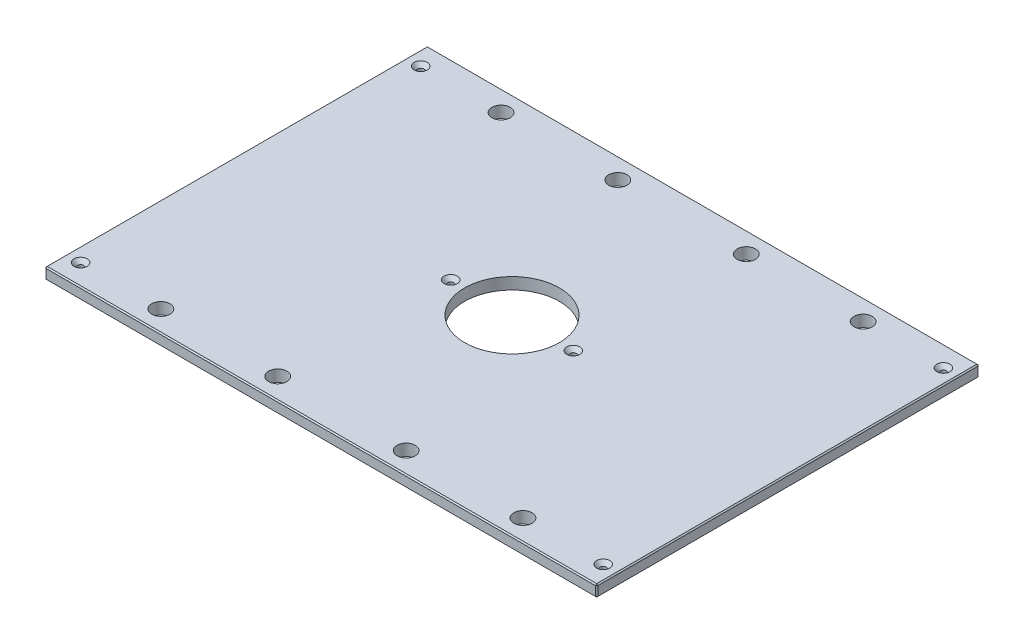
ISO-10303-21;
HEADER;
FILE_DESCRIPTION(('STEP AP214'),'2;1');
FILE_NAME('part.step','',(''),(''),'','','');
FILE_SCHEMA(('AUTOMOTIVE_DESIGN { 1 0 10303 214 1 1 1 1 }'));
ENDSEC;
DATA;
#1=APPLICATION_CONTEXT('core data for automotive mechanical design processes');
#2=APPLICATION_PROTOCOL_DEFINITION('international standard','automotive_design',2000,#1);
#3=PRODUCT_CONTEXT('',#1,'mechanical');
#4=PRODUCT('Part','Part','',(#3));
#5=PRODUCT_RELATED_PRODUCT_CATEGORY('part','',(#4));
#6=PRODUCT_DEFINITION_FORMATION('','',#4);
#7=PRODUCT_DEFINITION_CONTEXT('part definition',#1,'design');
#8=PRODUCT_DEFINITION('design','',#6,#7);
#9=PRODUCT_DEFINITION_SHAPE('','',#8);
#10=(LENGTH_UNIT() NAMED_UNIT(*) SI_UNIT(.MILLI.,.METRE.));
#11=(NAMED_UNIT(*) PLANE_ANGLE_UNIT() SI_UNIT($,.RADIAN.));
#12=(NAMED_UNIT(*) SI_UNIT($,.STERADIAN.) SOLID_ANGLE_UNIT());
#13=UNCERTAINTY_MEASURE_WITH_UNIT(LENGTH_MEASURE(1.E-05),#10,'distance_accuracy_value','');
#14=(GEOMETRIC_REPRESENTATION_CONTEXT(3) GLOBAL_UNCERTAINTY_ASSIGNED_CONTEXT((#13)) GLOBAL_UNIT_ASSIGNED_CONTEXT((#10,
#11,#12)) REPRESENTATION_CONTEXT('',''));
#15=CARTESIAN_POINT('',(0.,0.,0.));
#16=DIRECTION('',(0.,0.,1.));
#17=DIRECTION('',(1.,0.,0.));
#18=AXIS2_PLACEMENT_3D('',#15,#16,#17);
#19=CARTESIAN_POINT('',(-300.0375,12.7,-207.9625));
#20=DIRECTION('',(1.,0.,0.));
#21=DIRECTION('',(0.,0.,-1.));
#22=AXIS2_PLACEMENT_3D('',#19,#20,#21);
#23=PLANE('',#22);
#24=DIRECTION('',(0.,0.,-1.));
#25=VECTOR('',#24,1.);
#26=CARTESIAN_POINT('',(-300.0375,11.4300000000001,-207.9625));
#27=LINE('',#26,#25);
#28=CARTESIAN_POINT('',(-300.0375,11.4300000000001,206.6925));
#29=VERTEX_POINT('',#28);
#30=CARTESIAN_POINT('',(-300.0375,11.4300000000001,-206.6925));
#31=VERTEX_POINT('',#30);
#32=EDGE_CURVE('E135',#29,#31,#27,.T.);
#33=ORIENTED_EDGE('',*,*,#32,.T.);
#34=DIRECTION('',(0.,-1.,0.));
#35=VECTOR('',#34,1.);
#36=CARTESIAN_POINT('',(-300.0375,12.7,-206.6925));
#37=LINE('',#36,#35);
#38=CARTESIAN_POINT('',(-300.0375,1.26999999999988,-206.6925));
#39=VERTEX_POINT('',#38);
#40=EDGE_CURVE('E131',#31,#39,#37,.T.);
#41=ORIENTED_EDGE('',*,*,#40,.T.);
#42=DIRECTION('',(0.,0.,1.));
#43=VECTOR('',#42,1.);
#44=CARTESIAN_POINT('',(-300.0375,1.26999999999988,-207.9625));
#45=LINE('',#44,#43);
#46=CARTESIAN_POINT('',(-300.0375,1.26999999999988,206.6925));
#47=VERTEX_POINT('',#46);
#48=EDGE_CURVE('E126',#39,#47,#45,.T.);
#49=ORIENTED_EDGE('',*,*,#48,.T.);
#50=DIRECTION('',(0.,1.,0.));
#51=VECTOR('',#50,1.);
#52=CARTESIAN_POINT('',(-300.0375,12.7,206.6925));
#53=LINE('',#52,#51);
#54=EDGE_CURVE('E128',#47,#29,#53,.T.);
#55=ORIENTED_EDGE('',*,*,#54,.T.);
#56=EDGE_LOOP('',(#33,#41,#49,#55));
#57=FACE_BOUND('',#56,.T.);
#58=ADVANCED_FACE('F35',(#57),#23,.F.);
#59=CARTESIAN_POINT('',(-300.0375,12.7,207.9625));
#60=DIRECTION('',(0.,0.,-1.));
#61=DIRECTION('',(-1.,0.,0.));
#62=AXIS2_PLACEMENT_3D('',#59,#60,#61);
#63=PLANE('',#62);
#64=DIRECTION('',(1.,0.,0.));
#65=VECTOR('',#64,1.);
#66=CARTESIAN_POINT('',(-300.0375,1.26999999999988,207.9625));
#67=LINE('',#66,#65);
#68=CARTESIAN_POINT('',(-298.7675,1.26999999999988,207.9625));
#69=VERTEX_POINT('',#68);
#70=CARTESIAN_POINT('',(298.7675,1.26999999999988,207.9625));
#71=VERTEX_POINT('',#70);
#72=EDGE_CURVE('E58',#69,#71,#67,.T.);
#73=ORIENTED_EDGE('',*,*,#72,.T.);
#74=DIRECTION('',(0.,1.,0.));
#75=VECTOR('',#74,1.);
#76=CARTESIAN_POINT('',(298.7675,12.7,207.9625));
#77=LINE('',#76,#75);
#78=CARTESIAN_POINT('',(298.7675,11.4300000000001,207.9625));
#79=VERTEX_POINT('',#78);
#80=EDGE_CURVE('E11',#71,#79,#77,.T.);
#81=ORIENTED_EDGE('',*,*,#80,.T.);
#82=DIRECTION('',(-1.,0.,0.));
#83=VECTOR('',#82,1.);
#84=CARTESIAN_POINT('',(-300.0375,11.4300000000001,207.9625));
#85=LINE('',#84,#83);
#86=CARTESIAN_POINT('',(-298.7675,11.4300000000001,207.9625));
#87=VERTEX_POINT('',#86);
#88=EDGE_CURVE('E44',#79,#87,#85,.T.);
#89=ORIENTED_EDGE('',*,*,#88,.T.);
#90=DIRECTION('',(0.,-1.,0.));
#91=VECTOR('',#90,1.);
#92=CARTESIAN_POINT('',(-298.7675,12.7,207.9625));
#93=LINE('',#92,#91);
#94=EDGE_CURVE('E303',#87,#69,#93,.T.);
#95=ORIENTED_EDGE('',*,*,#94,.T.);
#96=EDGE_LOOP('',(#73,#81,#89,#95));
#97=FACE_BOUND('',#96,.T.);
#98=ADVANCED_FACE('F372',(#97),#63,.F.);
#99=CARTESIAN_POINT('',(300.0375,12.7,-207.9625));
#100=DIRECTION('',(-1.,0.,0.));
#101=DIRECTION('',(0.,0.,1.));
#102=AXIS2_PLACEMENT_3D('',#99,#100,#101);
#103=PLANE('',#102);
#104=DIRECTION('',(0.,0.,-1.));
#105=VECTOR('',#104,1.);
#106=CARTESIAN_POINT('',(300.0375,1.26999999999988,-207.9625));
#107=LINE('',#106,#105);
#108=CARTESIAN_POINT('',(300.0375,1.26999999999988,206.6925));
#109=VERTEX_POINT('',#108);
#110=CARTESIAN_POINT('',(300.0375,1.26999999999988,-206.6925));
#111=VERTEX_POINT('',#110);
#112=EDGE_CURVE('E298',#109,#111,#107,.T.);
#113=ORIENTED_EDGE('',*,*,#112,.T.);
#114=DIRECTION('',(0.,1.,0.));
#115=VECTOR('',#114,1.);
#116=CARTESIAN_POINT('',(300.0375,12.7,-206.6925));
#117=LINE('',#116,#115);
#118=CARTESIAN_POINT('',(300.0375,11.4300000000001,-206.6925));
#119=VERTEX_POINT('',#118);
#120=EDGE_CURVE('E300',#111,#119,#117,.T.);
#121=ORIENTED_EDGE('',*,*,#120,.T.);
#122=DIRECTION('',(0.,0.,1.));
#123=VECTOR('',#122,1.);
#124=CARTESIAN_POINT('',(300.0375,11.4300000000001,207.9625));
#125=LINE('',#124,#123);
#126=CARTESIAN_POINT('',(300.0375,11.4300000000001,206.6925));
#127=VERTEX_POINT('',#126);
#128=EDGE_CURVE('E296',#119,#127,#125,.T.);
#129=ORIENTED_EDGE('',*,*,#128,.T.);
#130=DIRECTION('',(0.,-1.,0.));
#131=VECTOR('',#130,1.);
#132=CARTESIAN_POINT('',(300.0375,12.7,206.6925));
#133=LINE('',#132,#131);
#134=EDGE_CURVE('E294',#127,#109,#133,.T.);
#135=ORIENTED_EDGE('',*,*,#134,.T.);
#136=EDGE_LOOP('',(#113,#121,#129,#135));
#137=FACE_BOUND('',#136,.T.);
#138=ADVANCED_FACE('F359',(#137),#103,.F.);
#139=CARTESIAN_POINT('',(-300.0375,12.7,-207.9625));
#140=DIRECTION('',(0.,0.,1.));
#141=DIRECTION('',(1.,0.,0.));
#142=AXIS2_PLACEMENT_3D('',#139,#140,#141);
#143=PLANE('',#142);
#144=DIRECTION('',(-1.,0.,0.));
#145=VECTOR('',#144,1.);
#146=CARTESIAN_POINT('',(-300.0375,1.26999999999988,-207.9625));
#147=LINE('',#146,#145);
#148=CARTESIAN_POINT('',(298.7675,1.26999999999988,-207.9625));
#149=VERTEX_POINT('',#148);
#150=CARTESIAN_POINT('',(-298.7675,1.26999999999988,-207.9625));
#151=VERTEX_POINT('',#150);
#152=EDGE_CURVE('E270',#149,#151,#147,.T.);
#153=ORIENTED_EDGE('',*,*,#152,.T.);
#154=DIRECTION('',(0.,1.,0.));
#155=VECTOR('',#154,1.);
#156=CARTESIAN_POINT('',(-298.7675,12.7,-207.9625));
#157=LINE('',#156,#155);
#158=CARTESIAN_POINT('',(-298.7675,11.4300000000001,-207.9625));
#159=VERTEX_POINT('',#158);
#160=EDGE_CURVE('E274',#151,#159,#157,.T.);
#161=ORIENTED_EDGE('',*,*,#160,.T.);
#162=DIRECTION('',(1.,0.,0.));
#163=VECTOR('',#162,1.);
#164=CARTESIAN_POINT('',(300.0375,11.4300000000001,-207.9625));
#165=LINE('',#164,#163);
#166=CARTESIAN_POINT('',(298.7675,11.4300000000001,-207.9625));
#167=VERTEX_POINT('',#166);
#168=EDGE_CURVE('E272',#159,#167,#165,.T.);
#169=ORIENTED_EDGE('',*,*,#168,.T.);
#170=DIRECTION('',(0.,-1.,0.));
#171=VECTOR('',#170,1.);
#172=CARTESIAN_POINT('',(298.7675,12.7,-207.9625));
#173=LINE('',#172,#171);
#174=EDGE_CURVE('E268',#167,#149,#173,.T.);
#175=ORIENTED_EDGE('',*,*,#174,.T.);
#176=EDGE_LOOP('',(#153,#161,#169,#175));
#177=FACE_BOUND('',#176,.T.);
#178=ADVANCED_FACE('F333',(#177),#143,.F.);
#179=CARTESIAN_POINT('',(0.,12.7,0.));
#180=DIRECTION('',(0.,1.,0.));
#181=DIRECTION('',(0.,0.,1.));
#182=AXIS2_PLACEMENT_3D('',#179,#180,#181);
#183=PLANE('',#182);
#184=CARTESIAN_POINT('',(284.1625,12.7,-184.94248));
#185=DIRECTION('',(0.,1.,0.));
#186=DIRECTION('',(0.,0.,1.));
#187=AXIS2_PLACEMENT_3D('',#184,#185,#186);
#188=CIRCLE('',#187,7.13740000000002);
#189=CARTESIAN_POINT('',(284.1625,12.7,-177.80508));
#190=VERTEX_POINT('',#189);
#191=EDGE_CURVE('E816',#190,#190,#188,.T.);
#192=ORIENTED_EDGE('',*,*,#191,.F.);
#193=EDGE_LOOP('',(#192));
#194=FACE_BOUND('',#193,.T.);
#195=CARTESIAN_POINT('',(284.1625,12.7,184.94248));
#196=DIRECTION('',(0.,1.,0.));
#197=DIRECTION('',(0.,0.,1.));
#198=AXIS2_PLACEMENT_3D('',#195,#196,#197);
#199=CIRCLE('',#198,7.13740000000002);
#200=CARTESIAN_POINT('',(284.1625,12.7,192.07988));
#201=VERTEX_POINT('',#200);
#202=EDGE_CURVE('E820',#201,#201,#199,.T.);
#203=ORIENTED_EDGE('',*,*,#202,.F.);
#204=EDGE_LOOP('',(#203));
#205=FACE_BOUND('',#204,.T.);
#206=CARTESIAN_POINT('',(-284.1625,12.7,184.94248));
#207=DIRECTION('',(0.,1.,0.));
#208=DIRECTION('',(0.,0.,1.));
#209=AXIS2_PLACEMENT_3D('',#206,#207,#208);
#210=CIRCLE('',#209,7.13740000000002);
#211=CARTESIAN_POINT('',(-284.1625,12.7,192.07988));
#212=VERTEX_POINT('',#211);
#213=EDGE_CURVE('E824',#212,#212,#210,.T.);
#214=ORIENTED_EDGE('',*,*,#213,.F.);
#215=EDGE_LOOP('',(#214));
#216=FACE_BOUND('',#215,.T.);
#217=CARTESIAN_POINT('',(-66.675,12.7,0.));
#218=DIRECTION('',(0.,1.,0.));
#219=DIRECTION('',(0.,0.,1.));
#220=AXIS2_PLACEMENT_3D('',#217,#218,#219);
#221=CIRCLE('',#220,7.1374);
#222=CARTESIAN_POINT('',(-66.675,12.7,7.1374));
#223=VERTEX_POINT('',#222);
#224=EDGE_CURVE('E828',#223,#223,#221,.T.);
#225=ORIENTED_EDGE('',*,*,#224,.F.);
#226=EDGE_LOOP('',(#225));
#227=FACE_BOUND('',#226,.T.);
#228=CARTESIAN_POINT('',(66.675,12.7,0.));
#229=DIRECTION('',(0.,1.,0.));
#230=DIRECTION('',(0.,0.,1.));
#231=AXIS2_PLACEMENT_3D('',#228,#229,#230);
#232=CIRCLE('',#231,7.1374);
#233=CARTESIAN_POINT('',(66.675,12.7,7.1374));
#234=VERTEX_POINT('',#233);
#235=EDGE_CURVE('E832',#234,#234,#232,.T.);
#236=ORIENTED_EDGE('',*,*,#235,.F.);
#237=EDGE_LOOP('',(#236));
#238=FACE_BOUND('',#237,.T.);
#239=CARTESIAN_POINT('',(-284.1625,12.7,-184.94248));
#240=DIRECTION('',(0.,1.,0.));
#241=DIRECTION('',(0.,0.,1.));
#242=AXIS2_PLACEMENT_3D('',#239,#240,#241);
#243=CIRCLE('',#242,7.13740000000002);
#244=CARTESIAN_POINT('',(-284.1625,12.7,-177.80508));
#245=VERTEX_POINT('',#244);
#246=EDGE_CURVE('E835',#245,#245,#243,.T.);
#247=ORIENTED_EDGE('',*,*,#246,.F.);
#248=EDGE_LOOP('',(#247));
#249=FACE_BOUND('',#248,.T.);
#250=DIRECTION('',(0.,0.,-1.));
#251=VECTOR('',#250,1.);
#252=CARTESIAN_POINT('',(298.7675,12.7,-207.9625));
#253=LINE('',#252,#251);
#254=CARTESIAN_POINT('',(298.7675,12.7,206.6925));
#255=VERTEX_POINT('',#254);
#256=CARTESIAN_POINT('',(298.7675,12.7,-206.6925));
#257=VERTEX_POINT('',#256);
#258=EDGE_CURVE('E281',#255,#257,#253,.T.);
#259=ORIENTED_EDGE('',*,*,#258,.T.);
#260=DIRECTION('',(-1.,0.,0.));
#261=VECTOR('',#260,1.);
#262=CARTESIAN_POINT('',(-300.0375,12.7,-206.6925));
#263=LINE('',#262,#261);
#264=CARTESIAN_POINT('',(-298.7675,12.7,-206.6925));
#265=VERTEX_POINT('',#264);
#266=EDGE_CURVE('E283',#257,#265,#263,.T.);
#267=ORIENTED_EDGE('',*,*,#266,.T.);
#268=DIRECTION('',(0.,0.,1.));
#269=VECTOR('',#268,1.);
#270=CARTESIAN_POINT('',(-298.7675,12.7,207.9625));
#271=LINE('',#270,#269);
#272=CARTESIAN_POINT('',(-298.7675,12.7,206.6925));
#273=VERTEX_POINT('',#272);
#274=EDGE_CURVE('E279',#265,#273,#271,.T.);
#275=ORIENTED_EDGE('',*,*,#274,.T.);
#276=DIRECTION('',(1.,0.,0.));
#277=VECTOR('',#276,1.);
#278=CARTESIAN_POINT('',(300.0375,12.7,206.6925));
#279=LINE('',#278,#277);
#280=EDGE_CURVE('E277',#273,#255,#279,.T.);
#281=ORIENTED_EDGE('',*,*,#280,.T.);
#282=EDGE_LOOP('',(#259,#267,#275,#281));
#283=FACE_BOUND('',#282,.T.);
#284=CARTESIAN_POINT('',(196.85,12.7,-184.94248));
#285=DIRECTION('',(0.,1.,0.));
#286=DIRECTION('',(0.,0.,1.));
#287=AXIS2_PLACEMENT_3D('',#284,#285,#286);
#288=CIRCLE('',#287,9.921875);
#289=CARTESIAN_POINT('',(196.85,12.7,-175.020605));
#290=VERTEX_POINT('',#289);
#291=EDGE_CURVE('E204',#290,#290,#288,.T.);
#292=ORIENTED_EDGE('',*,*,#291,.F.);
#293=EDGE_LOOP('',(#292));
#294=FACE_BOUND('',#293,.T.);
#295=CARTESIAN_POINT('',(-196.85,12.7,-184.94248));
#296=DIRECTION('',(0.,1.,0.));
#297=DIRECTION('',(0.,0.,1.));
#298=AXIS2_PLACEMENT_3D('',#295,#296,#297);
#299=CIRCLE('',#298,9.921875);
#300=CARTESIAN_POINT('',(-196.85,12.7,-175.020605));
#301=VERTEX_POINT('',#300);
#302=EDGE_CURVE('E214',#301,#301,#299,.T.);
#303=ORIENTED_EDGE('',*,*,#302,.F.);
#304=EDGE_LOOP('',(#303));
#305=FACE_BOUND('',#304,.T.);
#306=CARTESIAN_POINT('',(196.85,12.7,184.94248));
#307=DIRECTION('',(0.,1.,0.));
#308=DIRECTION('',(0.,0.,1.));
#309=AXIS2_PLACEMENT_3D('',#306,#307,#308);
#310=CIRCLE('',#309,9.921875);
#311=CARTESIAN_POINT('',(196.85,12.7,194.864355));
#312=VERTEX_POINT('',#311);
#313=EDGE_CURVE('E225',#312,#312,#310,.T.);
#314=ORIENTED_EDGE('',*,*,#313,.F.);
#315=EDGE_LOOP('',(#314));
#316=FACE_BOUND('',#315,.T.);
#317=CARTESIAN_POINT('',(-196.85,12.7,184.94248));
#318=DIRECTION('',(0.,1.,0.));
#319=DIRECTION('',(0.,0.,1.));
#320=AXIS2_PLACEMENT_3D('',#317,#318,#319);
#321=CIRCLE('',#320,9.921875);
#322=CARTESIAN_POINT('',(-196.85,12.7,194.864355));
#323=VERTEX_POINT('',#322);
#324=EDGE_CURVE('E231',#323,#323,#321,.T.);
#325=ORIENTED_EDGE('',*,*,#324,.F.);
#326=EDGE_LOOP('',(#325));
#327=FACE_BOUND('',#326,.T.);
#328=CARTESIAN_POINT('',(-69.85,12.7,-184.94248));
#329=DIRECTION('',(0.,1.,0.));
#330=DIRECTION('',(0.,0.,1.));
#331=AXIS2_PLACEMENT_3D('',#328,#329,#330);
#332=CIRCLE('',#331,9.921875);
#333=CARTESIAN_POINT('',(-69.85,12.7,-175.020605));
#334=VERTEX_POINT('',#333);
#335=EDGE_CURVE('E237',#334,#334,#332,.T.);
#336=ORIENTED_EDGE('',*,*,#335,.F.);
#337=EDGE_LOOP('',(#336));
#338=FACE_BOUND('',#337,.T.);
#339=CARTESIAN_POINT('',(69.85,12.7,-184.94248));
#340=DIRECTION('',(0.,1.,0.));
#341=DIRECTION('',(0.,0.,1.));
#342=AXIS2_PLACEMENT_3D('',#339,#340,#341);
#343=CIRCLE('',#342,9.921875);
#344=CARTESIAN_POINT('',(69.85,12.7,-175.020605));
#345=VERTEX_POINT('',#344);
#346=EDGE_CURVE('E243',#345,#345,#343,.T.);
#347=ORIENTED_EDGE('',*,*,#346,.F.);
#348=EDGE_LOOP('',(#347));
#349=FACE_BOUND('',#348,.T.);
#350=CARTESIAN_POINT('',(69.85,12.7,184.94248));
#351=DIRECTION('',(0.,1.,0.));
#352=DIRECTION('',(0.,0.,1.));
#353=AXIS2_PLACEMENT_3D('',#350,#351,#352);
#354=CIRCLE('',#353,9.921875);
#355=CARTESIAN_POINT('',(69.85,12.7,194.864355));
#356=VERTEX_POINT('',#355);
#357=EDGE_CURVE('E249',#356,#356,#354,.T.);
#358=ORIENTED_EDGE('',*,*,#357,.F.);
#359=EDGE_LOOP('',(#358));
#360=FACE_BOUND('',#359,.T.);
#361=CARTESIAN_POINT('',(-69.85,12.7,184.94248));
#362=DIRECTION('',(0.,1.,0.));
#363=DIRECTION('',(0.,0.,1.));
#364=AXIS2_PLACEMENT_3D('',#361,#362,#363);
#365=CIRCLE('',#364,9.921875);
#366=CARTESIAN_POINT('',(-69.85,12.7,194.864355));
#367=VERTEX_POINT('',#366);
#368=EDGE_CURVE('E255',#367,#367,#365,.T.);
#369=ORIENTED_EDGE('',*,*,#368,.F.);
#370=EDGE_LOOP('',(#369));
#371=FACE_BOUND('',#370,.T.);
#372=CARTESIAN_POINT('',(0.,12.7,0.));
#373=DIRECTION('',(0.,1.,0.));
#374=DIRECTION('',(0.,0.,1.));
#375=AXIS2_PLACEMENT_3D('',#372,#373,#374);
#376=CIRCLE('',#375,51.562);
#377=CARTESIAN_POINT('',(0.,12.7,51.562));
#378=VERTEX_POINT('',#377);
#379=EDGE_CURVE('E261',#378,#378,#376,.T.);
#380=ORIENTED_EDGE('',*,*,#379,.F.);
#381=EDGE_LOOP('',(#380));
#382=FACE_BOUND('',#381,.T.);
#383=ADVANCED_FACE('F381',(#194,#205,#216,#227,#238,#249,#283,#294,#305,#316,#327,#338,#349,
#360,#371,#382),#183,.T.);
#384=CARTESIAN_POINT('',(0.,0.,0.));
#385=DIRECTION('',(0.,1.,0.));
#386=DIRECTION('',(0.,0.,1.));
#387=AXIS2_PLACEMENT_3D('',#384,#385,#386);
#388=PLANE('',#387);
#389=CARTESIAN_POINT('',(284.1625,0.,-184.94248));
#390=DIRECTION('',(0.,1.,0.));
#391=DIRECTION('',(0.,0.,1.));
#392=AXIS2_PLACEMENT_3D('',#389,#390,#391);
#393=CIRCLE('',#392,3.3782);
#394=CARTESIAN_POINT('',(284.1625,0.,-181.56428));
#395=VERTEX_POINT('',#394);
#396=EDGE_CURVE('E869',#395,#395,#393,.T.);
#397=ORIENTED_EDGE('',*,*,#396,.T.);
#398=EDGE_LOOP('',(#397));
#399=FACE_BOUND('',#398,.T.);
#400=CARTESIAN_POINT('',(284.1625,0.,184.94248));
#401=DIRECTION('',(0.,1.,0.));
#402=DIRECTION('',(0.,0.,1.));
#403=AXIS2_PLACEMENT_3D('',#400,#401,#402);
#404=CIRCLE('',#403,3.3782);
#405=CARTESIAN_POINT('',(284.1625,0.,188.32068));
#406=VERTEX_POINT('',#405);
#407=EDGE_CURVE('E862',#406,#406,#404,.T.);
#408=ORIENTED_EDGE('',*,*,#407,.T.);
#409=EDGE_LOOP('',(#408));
#410=FACE_BOUND('',#409,.T.);
#411=CARTESIAN_POINT('',(-284.1625,0.,184.94248));
#412=DIRECTION('',(0.,1.,0.));
#413=DIRECTION('',(0.,0.,1.));
#414=AXIS2_PLACEMENT_3D('',#411,#412,#413);
#415=CIRCLE('',#414,3.3782);
#416=CARTESIAN_POINT('',(-284.1625,0.,188.32068));
#417=VERTEX_POINT('',#416);
#418=EDGE_CURVE('E855',#417,#417,#415,.T.);
#419=ORIENTED_EDGE('',*,*,#418,.T.);
#420=EDGE_LOOP('',(#419));
#421=FACE_BOUND('',#420,.T.);
#422=CARTESIAN_POINT('',(-66.675,0.,0.));
#423=DIRECTION('',(0.,1.,0.));
#424=DIRECTION('',(0.,0.,1.));
#425=AXIS2_PLACEMENT_3D('',#422,#423,#424);
#426=CIRCLE('',#425,3.3782);
#427=CARTESIAN_POINT('',(-66.675,0.,3.3782));
#428=VERTEX_POINT('',#427);
#429=EDGE_CURVE('E848',#428,#428,#426,.T.);
#430=ORIENTED_EDGE('',*,*,#429,.T.);
#431=EDGE_LOOP('',(#430));
#432=FACE_BOUND('',#431,.T.);
#433=CARTESIAN_POINT('',(66.675,0.,0.));
#434=DIRECTION('',(0.,1.,0.));
#435=DIRECTION('',(0.,0.,1.));
#436=AXIS2_PLACEMENT_3D('',#433,#434,#435);
#437=CIRCLE('',#436,3.3782);
#438=CARTESIAN_POINT('',(66.675,0.,3.3782));
#439=VERTEX_POINT('',#438);
#440=EDGE_CURVE('E838',#439,#439,#437,.T.);
#441=ORIENTED_EDGE('',*,*,#440,.T.);
#442=EDGE_LOOP('',(#441));
#443=FACE_BOUND('',#442,.T.);
#444=CARTESIAN_POINT('',(-284.1625,0.,-184.94248));
#445=DIRECTION('',(0.,1.,0.));
#446=DIRECTION('',(0.,0.,1.));
#447=AXIS2_PLACEMENT_3D('',#444,#445,#446);
#448=CIRCLE('',#447,3.3782);
#449=CARTESIAN_POINT('',(-284.1625,0.,-181.56428));
#450=VERTEX_POINT('',#449);
#451=EDGE_CURVE('E217',#450,#450,#448,.T.);
#452=ORIENTED_EDGE('',*,*,#451,.T.);
#453=EDGE_LOOP('',(#452));
#454=FACE_BOUND('',#453,.T.);
#455=DIRECTION('',(0.,0.,-1.));
#456=VECTOR('',#455,1.);
#457=CARTESIAN_POINT('',(-298.7675,0.,0.));
#458=LINE('',#457,#456);
#459=CARTESIAN_POINT('',(-298.7675,0.,206.6925));
#460=VERTEX_POINT('',#459);
#461=CARTESIAN_POINT('',(-298.7675,0.,-206.6925));
#462=VERTEX_POINT('',#461);
#463=EDGE_CURVE('E158',#460,#462,#458,.T.);
#464=ORIENTED_EDGE('',*,*,#463,.T.);
#465=DIRECTION('',(1.,0.,0.));
#466=VECTOR('',#465,1.);
#467=CARTESIAN_POINT('',(0.,0.,-206.6925));
#468=LINE('',#467,#466);
#469=CARTESIAN_POINT('',(298.7675,0.,-206.6925));
#470=VERTEX_POINT('',#469);
#471=EDGE_CURVE('E291',#462,#470,#468,.T.);
#472=ORIENTED_EDGE('',*,*,#471,.T.);
#473=DIRECTION('',(0.,0.,1.));
#474=VECTOR('',#473,1.);
#475=CARTESIAN_POINT('',(298.7675,0.,0.));
#476=LINE('',#475,#474);
#477=CARTESIAN_POINT('',(298.7675,0.,206.6925));
#478=VERTEX_POINT('',#477);
#479=EDGE_CURVE('E289',#470,#478,#476,.T.);
#480=ORIENTED_EDGE('',*,*,#479,.T.);
#481=DIRECTION('',(-1.,0.,0.));
#482=VECTOR('',#481,1.);
#483=CARTESIAN_POINT('',(0.,0.,206.6925));
#484=LINE('',#483,#482);
#485=EDGE_CURVE('E286',#478,#460,#484,.T.);
#486=ORIENTED_EDGE('',*,*,#485,.T.);
#487=EDGE_LOOP('',(#464,#472,#480,#486));
#488=FACE_BOUND('',#487,.T.);
#489=CARTESIAN_POINT('',(196.85,0.,-184.94248));
#490=DIRECTION('',(0.,1.,0.));
#491=DIRECTION('',(0.,0.,1.));
#492=AXIS2_PLACEMENT_3D('',#489,#490,#491);
#493=CIRCLE('',#492,9.921875);
#494=CARTESIAN_POINT('',(196.85,0.,-175.020605));
#495=VERTEX_POINT('',#494);
#496=EDGE_CURVE('E209',#495,#495,#493,.T.);
#497=ORIENTED_EDGE('',*,*,#496,.T.);
#498=EDGE_LOOP('',(#497));
#499=FACE_BOUND('',#498,.T.);
#500=CARTESIAN_POINT('',(-196.85,0.,-184.94248));
#501=DIRECTION('',(0.,1.,0.));
#502=DIRECTION('',(0.,0.,1.));
#503=AXIS2_PLACEMENT_3D('',#500,#501,#502);
#504=CIRCLE('',#503,9.921875);
#505=CARTESIAN_POINT('',(-196.85,0.,-175.020605));
#506=VERTEX_POINT('',#505);
#507=EDGE_CURVE('E222',#506,#506,#504,.T.);
#508=ORIENTED_EDGE('',*,*,#507,.T.);
#509=EDGE_LOOP('',(#508));
#510=FACE_BOUND('',#509,.T.);
#511=CARTESIAN_POINT('',(196.85,0.,184.94248));
#512=DIRECTION('',(0.,1.,0.));
#513=DIRECTION('',(0.,0.,1.));
#514=AXIS2_PLACEMENT_3D('',#511,#512,#513);
#515=CIRCLE('',#514,9.921875);
#516=CARTESIAN_POINT('',(196.85,0.,194.864355));
#517=VERTEX_POINT('',#516);
#518=EDGE_CURVE('E228',#517,#517,#515,.T.);
#519=ORIENTED_EDGE('',*,*,#518,.T.);
#520=EDGE_LOOP('',(#519));
#521=FACE_BOUND('',#520,.T.);
#522=CARTESIAN_POINT('',(-196.85,0.,184.94248));
#523=DIRECTION('',(0.,1.,0.));
#524=DIRECTION('',(0.,0.,1.));
#525=AXIS2_PLACEMENT_3D('',#522,#523,#524);
#526=CIRCLE('',#525,9.921875);
#527=CARTESIAN_POINT('',(-196.85,0.,194.864355));
#528=VERTEX_POINT('',#527);
#529=EDGE_CURVE('E234',#528,#528,#526,.T.);
#530=ORIENTED_EDGE('',*,*,#529,.T.);
#531=EDGE_LOOP('',(#530));
#532=FACE_BOUND('',#531,.T.);
#533=CARTESIAN_POINT('',(-69.85,0.,-184.94248));
#534=DIRECTION('',(0.,1.,0.));
#535=DIRECTION('',(0.,0.,1.));
#536=AXIS2_PLACEMENT_3D('',#533,#534,#535);
#537=CIRCLE('',#536,9.921875);
#538=CARTESIAN_POINT('',(-69.85,0.,-175.020605));
#539=VERTEX_POINT('',#538);
#540=EDGE_CURVE('E240',#539,#539,#537,.T.);
#541=ORIENTED_EDGE('',*,*,#540,.T.);
#542=EDGE_LOOP('',(#541));
#543=FACE_BOUND('',#542,.T.);
#544=CARTESIAN_POINT('',(69.85,0.,-184.94248));
#545=DIRECTION('',(0.,1.,0.));
#546=DIRECTION('',(0.,0.,1.));
#547=AXIS2_PLACEMENT_3D('',#544,#545,#546);
#548=CIRCLE('',#547,9.921875);
#549=CARTESIAN_POINT('',(69.85,0.,-175.020605));
#550=VERTEX_POINT('',#549);
#551=EDGE_CURVE('E246',#550,#550,#548,.T.);
#552=ORIENTED_EDGE('',*,*,#551,.T.);
#553=EDGE_LOOP('',(#552));
#554=FACE_BOUND('',#553,.T.);
#555=CARTESIAN_POINT('',(69.85,0.,184.94248));
#556=DIRECTION('',(0.,1.,0.));
#557=DIRECTION('',(0.,0.,1.));
#558=AXIS2_PLACEMENT_3D('',#555,#556,#557);
#559=CIRCLE('',#558,9.921875);
#560=CARTESIAN_POINT('',(69.85,0.,194.864355));
#561=VERTEX_POINT('',#560);
#562=EDGE_CURVE('E252',#561,#561,#559,.T.);
#563=ORIENTED_EDGE('',*,*,#562,.T.);
#564=EDGE_LOOP('',(#563));
#565=FACE_BOUND('',#564,.T.);
#566=CARTESIAN_POINT('',(-69.85,0.,184.94248));
#567=DIRECTION('',(0.,1.,0.));
#568=DIRECTION('',(0.,0.,1.));
#569=AXIS2_PLACEMENT_3D('',#566,#567,#568);
#570=CIRCLE('',#569,9.921875);
#571=CARTESIAN_POINT('',(-69.85,0.,194.864355));
#572=VERTEX_POINT('',#571);
#573=EDGE_CURVE('E258',#572,#572,#570,.T.);
#574=ORIENTED_EDGE('',*,*,#573,.T.);
#575=EDGE_LOOP('',(#574));
#576=FACE_BOUND('',#575,.T.);
#577=CARTESIAN_POINT('',(0.,0.,0.));
#578=DIRECTION('',(0.,1.,0.));
#579=DIRECTION('',(0.,0.,1.));
#580=AXIS2_PLACEMENT_3D('',#577,#578,#579);
#581=CIRCLE('',#580,51.562);
#582=CARTESIAN_POINT('',(0.,0.,51.562));
#583=VERTEX_POINT('',#582);
#584=EDGE_CURVE('E147',#583,#583,#581,.T.);
#585=ORIENTED_EDGE('',*,*,#584,.T.);
#586=EDGE_LOOP('',(#585));
#587=FACE_BOUND('',#586,.T.);
#588=ADVANCED_FACE('F346',(#399,#410,#421,#432,#443,#454,#488,#499,#510,#521,#532,#543,#554,
#565,#576,#587),#388,.F.);
#589=CARTESIAN_POINT('',(0.,0.,0.));
#590=DIRECTION('',(0.,1.,0.));
#591=DIRECTION('',(0.,0.,1.));
#592=AXIS2_PLACEMENT_3D('',#589,#590,#591);
#593=CYLINDRICAL_SURFACE('',#592,51.562);
#594=ORIENTED_EDGE('',*,*,#584,.F.);
#595=EDGE_LOOP('',(#594));
#596=FACE_BOUND('',#595,.T.);
#597=ORIENTED_EDGE('',*,*,#379,.T.);
#598=EDGE_LOOP('',(#597));
#599=FACE_BOUND('',#598,.T.);
#600=ADVANCED_FACE('F751',(#596,#599),#593,.F.);
#601=CARTESIAN_POINT('',(-69.85,12.7,184.94248));
#602=DIRECTION('',(0.,1.,0.));
#603=DIRECTION('',(0.,0.,1.));
#604=AXIS2_PLACEMENT_3D('',#601,#602,#603);
#605=CYLINDRICAL_SURFACE('',#604,9.921875);
#606=ORIENTED_EDGE('',*,*,#573,.F.);
#607=EDGE_LOOP('',(#606));
#608=FACE_BOUND('',#607,.T.);
#609=ORIENTED_EDGE('',*,*,#368,.T.);
#610=EDGE_LOOP('',(#609));
#611=FACE_BOUND('',#610,.T.);
#612=ADVANCED_FACE('F742',(#608,#611),#605,.F.);
#613=CARTESIAN_POINT('',(69.85,12.7,184.94248));
#614=DIRECTION('',(0.,1.,0.));
#615=DIRECTION('',(0.,0.,1.));
#616=AXIS2_PLACEMENT_3D('',#613,#614,#615);
#617=CYLINDRICAL_SURFACE('',#616,9.921875);
#618=ORIENTED_EDGE('',*,*,#562,.F.);
#619=EDGE_LOOP('',(#618));
#620=FACE_BOUND('',#619,.T.);
#621=ORIENTED_EDGE('',*,*,#357,.T.);
#622=EDGE_LOOP('',(#621));
#623=FACE_BOUND('',#622,.T.);
#624=ADVANCED_FACE('F733',(#620,#623),#617,.F.);
#625=CARTESIAN_POINT('',(69.85,12.7,-184.94248));
#626=DIRECTION('',(0.,1.,0.));
#627=DIRECTION('',(0.,0.,1.));
#628=AXIS2_PLACEMENT_3D('',#625,#626,#627);
#629=CYLINDRICAL_SURFACE('',#628,9.921875);
#630=ORIENTED_EDGE('',*,*,#551,.F.);
#631=EDGE_LOOP('',(#630));
#632=FACE_BOUND('',#631,.T.);
#633=ORIENTED_EDGE('',*,*,#346,.T.);
#634=EDGE_LOOP('',(#633));
#635=FACE_BOUND('',#634,.T.);
#636=ADVANCED_FACE('F724',(#632,#635),#629,.F.);
#637=CARTESIAN_POINT('',(-69.85,12.7,-184.94248));
#638=DIRECTION('',(0.,1.,0.));
#639=DIRECTION('',(0.,0.,1.));
#640=AXIS2_PLACEMENT_3D('',#637,#638,#639);
#641=CYLINDRICAL_SURFACE('',#640,9.921875);
#642=ORIENTED_EDGE('',*,*,#540,.F.);
#643=EDGE_LOOP('',(#642));
#644=FACE_BOUND('',#643,.T.);
#645=ORIENTED_EDGE('',*,*,#335,.T.);
#646=EDGE_LOOP('',(#645));
#647=FACE_BOUND('',#646,.T.);
#648=ADVANCED_FACE('F715',(#644,#647),#641,.F.);
#649=CARTESIAN_POINT('',(-196.85,12.7,184.94248));
#650=DIRECTION('',(0.,1.,0.));
#651=DIRECTION('',(0.,0.,1.));
#652=AXIS2_PLACEMENT_3D('',#649,#650,#651);
#653=CYLINDRICAL_SURFACE('',#652,9.921875);
#654=ORIENTED_EDGE('',*,*,#529,.F.);
#655=EDGE_LOOP('',(#654));
#656=FACE_BOUND('',#655,.T.);
#657=ORIENTED_EDGE('',*,*,#324,.T.);
#658=EDGE_LOOP('',(#657));
#659=FACE_BOUND('',#658,.T.);
#660=ADVANCED_FACE('F706',(#656,#659),#653,.F.);
#661=CARTESIAN_POINT('',(196.85,12.7,184.94248));
#662=DIRECTION('',(0.,1.,0.));
#663=DIRECTION('',(0.,0.,1.));
#664=AXIS2_PLACEMENT_3D('',#661,#662,#663);
#665=CYLINDRICAL_SURFACE('',#664,9.921875);
#666=ORIENTED_EDGE('',*,*,#518,.F.);
#667=EDGE_LOOP('',(#666));
#668=FACE_BOUND('',#667,.T.);
#669=ORIENTED_EDGE('',*,*,#313,.T.);
#670=EDGE_LOOP('',(#669));
#671=FACE_BOUND('',#670,.T.);
#672=ADVANCED_FACE('F697',(#668,#671),#665,.F.);
#673=CARTESIAN_POINT('',(-196.85,12.7,-184.94248));
#674=DIRECTION('',(0.,1.,0.));
#675=DIRECTION('',(0.,0.,1.));
#676=AXIS2_PLACEMENT_3D('',#673,#674,#675);
#677=CYLINDRICAL_SURFACE('',#676,9.921875);
#678=ORIENTED_EDGE('',*,*,#507,.F.);
#679=EDGE_LOOP('',(#678));
#680=FACE_BOUND('',#679,.T.);
#681=ORIENTED_EDGE('',*,*,#302,.T.);
#682=EDGE_LOOP('',(#681));
#683=FACE_BOUND('',#682,.T.);
#684=ADVANCED_FACE('F687',(#680,#683),#677,.F.);
#685=CARTESIAN_POINT('',(196.85,12.7,-184.94248));
#686=DIRECTION('',(0.,1.,0.));
#687=DIRECTION('',(0.,0.,1.));
#688=AXIS2_PLACEMENT_3D('',#685,#686,#687);
#689=CYLINDRICAL_SURFACE('',#688,9.921875);
#690=ORIENTED_EDGE('',*,*,#496,.F.);
#691=EDGE_LOOP('',(#690));
#692=FACE_BOUND('',#691,.T.);
#693=ORIENTED_EDGE('',*,*,#291,.T.);
#694=EDGE_LOOP('',(#693));
#695=FACE_BOUND('',#694,.T.);
#696=ADVANCED_FACE('F390',(#692,#695),#689,.F.);
#697=CARTESIAN_POINT('',(300.0375,12.7,206.6925));
#698=DIRECTION('',(-0.707106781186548,0.,-0.707106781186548));
#699=DIRECTION('',(0.,-1.,0.));
#700=AXIS2_PLACEMENT_3D('',#697,#698,#699);
#701=PLANE('',#700);
#702=DIRECTION('',(-0.707106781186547,0.,0.707106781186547));
#703=VECTOR('',#702,1.);
#704=CARTESIAN_POINT('',(300.0375,11.4300000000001,206.6925));
#705=LINE('',#704,#703);
#706=EDGE_CURVE('E39',#79,#127,#705,.F.);
#707=ORIENTED_EDGE('',*,*,#706,.F.);
#708=ORIENTED_EDGE('',*,*,#80,.F.);
#709=DIRECTION('',(0.707106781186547,0.,-0.707106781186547));
#710=VECTOR('',#709,1.);
#711=CARTESIAN_POINT('',(299.4025,1.26999999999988,207.3275));
#712=LINE('',#711,#710);
#713=EDGE_CURVE('E197',#109,#71,#712,.F.);
#714=ORIENTED_EDGE('',*,*,#713,.F.);
#715=ORIENTED_EDGE('',*,*,#134,.F.);
#716=EDGE_LOOP('',(#707,#708,#714,#715));
#717=FACE_BOUND('',#716,.T.);
#718=ADVANCED_FACE('F37',(#717),#701,.F.);
#719=CARTESIAN_POINT('',(300.0375,11.4300000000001,206.6925));
#720=DIRECTION('',(0.577350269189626,0.577350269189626,0.577350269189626));
#721=DIRECTION('',(0.707106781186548,0.,-0.707106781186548));
#722=AXIS2_PLACEMENT_3D('',#719,#720,#721);
#723=PLANE('',#722);
#724=DIRECTION('',(0.,-0.707106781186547,0.707106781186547));
#725=VECTOR('',#724,1.);
#726=CARTESIAN_POINT('',(298.7675,12.0650000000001,207.3275));
#727=LINE('',#726,#725);
#728=EDGE_CURVE('E193',#79,#255,#727,.F.);
#729=ORIENTED_EDGE('',*,*,#728,.F.);
#730=ORIENTED_EDGE('',*,*,#706,.T.);
#731=DIRECTION('',(-0.707106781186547,0.707106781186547,0.));
#732=VECTOR('',#731,1.);
#733=CARTESIAN_POINT('',(300.0375,11.4300000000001,206.6925));
#734=LINE('',#733,#732);
#735=EDGE_CURVE('E195',#255,#127,#734,.F.);
#736=ORIENTED_EDGE('',*,*,#735,.F.);
#737=EDGE_LOOP('',(#729,#730,#736));
#738=FACE_BOUND('',#737,.T.);
#739=ADVANCED_FACE('F383',(#738),#723,.T.);
#740=CARTESIAN_POINT('',(298.7675,0.,206.6925));
#741=DIRECTION('',(0.577350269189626,-0.577350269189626,0.577350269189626));
#742=DIRECTION('',(0.707106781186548,0.,-0.707106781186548));
#743=AXIS2_PLACEMENT_3D('',#740,#741,#742);
#744=PLANE('',#743);
#745=DIRECTION('',(-0.707106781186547,-0.707106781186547,0.));
#746=VECTOR('',#745,1.);
#747=CARTESIAN_POINT('',(298.7675,0.,206.6925));
#748=LINE('',#747,#746);
#749=EDGE_CURVE('E187',#109,#478,#748,.T.);
#750=ORIENTED_EDGE('',*,*,#749,.F.);
#751=ORIENTED_EDGE('',*,*,#713,.T.);
#752=DIRECTION('',(0.,0.707106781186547,0.707106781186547));
#753=VECTOR('',#752,1.);
#754=CARTESIAN_POINT('',(298.7675,0.,206.6925));
#755=LINE('',#754,#753);
#756=EDGE_CURVE('E190',#478,#71,#755,.T.);
#757=ORIENTED_EDGE('',*,*,#756,.F.);
#758=EDGE_LOOP('',(#750,#751,#757));
#759=FACE_BOUND('',#758,.T.);
#760=ADVANCED_FACE('F352',(#759),#744,.T.);
#761=CARTESIAN_POINT('',(298.7675,12.7,0.));
#762=DIRECTION('',(0.707106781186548,0.707106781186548,0.));
#763=DIRECTION('',(0.,0.,1.));
#764=AXIS2_PLACEMENT_3D('',#761,#762,#763);
#765=PLANE('',#764);
#766=ORIENTED_EDGE('',*,*,#735,.T.);
#767=ORIENTED_EDGE('',*,*,#128,.F.);
#768=DIRECTION('',(0.707106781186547,-0.707106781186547,0.));
#769=VECTOR('',#768,1.);
#770=CARTESIAN_POINT('',(299.4025,12.0650000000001,-206.6925));
#771=LINE('',#770,#769);
#772=EDGE_CURVE('E182',#257,#119,#771,.T.);
#773=ORIENTED_EDGE('',*,*,#772,.F.);
#774=ORIENTED_EDGE('',*,*,#258,.F.);
#775=EDGE_LOOP('',(#766,#767,#773,#774));
#776=FACE_BOUND('',#775,.T.);
#777=ADVANCED_FACE('F369',(#776),#765,.T.);
#778=CARTESIAN_POINT('',(0.,12.7,206.6925));
#779=DIRECTION('',(0.,0.707106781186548,0.707106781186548));
#780=DIRECTION('',(-1.,0.,0.));
#781=AXIS2_PLACEMENT_3D('',#778,#779,#780);
#782=PLANE('',#781);
#783=ORIENTED_EDGE('',*,*,#728,.T.);
#784=ORIENTED_EDGE('',*,*,#280,.F.);
#785=DIRECTION('',(0.,0.707106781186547,-0.707106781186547));
#786=VECTOR('',#785,1.);
#787=CARTESIAN_POINT('',(-298.7675,12.7,206.6925));
#788=LINE('',#787,#786);
#789=EDGE_CURVE('E179',#87,#273,#788,.T.);
#790=ORIENTED_EDGE('',*,*,#789,.F.);
#791=ORIENTED_EDGE('',*,*,#88,.F.);
#792=EDGE_LOOP('',(#783,#784,#790,#791));
#793=FACE_BOUND('',#792,.T.);
#794=ADVANCED_FACE('F374',(#793),#782,.T.);
#795=CARTESIAN_POINT('',(-298.7675,12.7,207.9625));
#796=DIRECTION('',(0.707106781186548,0.,-0.707106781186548));
#797=DIRECTION('',(0.,-1.,0.));
#798=AXIS2_PLACEMENT_3D('',#795,#796,#797);
#799=PLANE('',#798);
#800=DIRECTION('',(0.707106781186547,0.,0.707106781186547));
#801=VECTOR('',#800,1.);
#802=CARTESIAN_POINT('',(-300.0375,1.26999999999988,206.6925));
#803=LINE('',#802,#801);
#804=EDGE_CURVE('E142',#69,#47,#803,.F.);
#805=ORIENTED_EDGE('',*,*,#804,.F.);
#806=ORIENTED_EDGE('',*,*,#94,.F.);
#807=DIRECTION('',(-0.707106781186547,0.,-0.707106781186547));
#808=VECTOR('',#807,1.);
#809=CARTESIAN_POINT('',(-299.4025,11.4300000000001,207.3275));
#810=LINE('',#809,#808);
#811=EDGE_CURVE('E145',#29,#87,#810,.F.);
#812=ORIENTED_EDGE('',*,*,#811,.F.);
#813=ORIENTED_EDGE('',*,*,#54,.F.);
#814=EDGE_LOOP('',(#805,#806,#812,#813));
#815=FACE_BOUND('',#814,.T.);
#816=ADVANCED_FACE('F140',(#815),#799,.F.);
#817=CARTESIAN_POINT('',(-300.0375,1.26999999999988,207.9625));
#818=DIRECTION('',(0.,0.707106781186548,-0.707106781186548));
#819=DIRECTION('',(1.,0.,0.));
#820=AXIS2_PLACEMENT_3D('',#817,#818,#819);
#821=PLANE('',#820);
#822=ORIENTED_EDGE('',*,*,#756,.T.);
#823=ORIENTED_EDGE('',*,*,#72,.F.);
#824=DIRECTION('',(0.,-0.707106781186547,-0.707106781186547));
#825=VECTOR('',#824,1.);
#826=CARTESIAN_POINT('',(-298.7675,0.634999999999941,207.3275));
#827=LINE('',#826,#825);
#828=EDGE_CURVE('E155',#460,#69,#827,.F.);
#829=ORIENTED_EDGE('',*,*,#828,.F.);
#830=ORIENTED_EDGE('',*,*,#485,.F.);
#831=EDGE_LOOP('',(#822,#823,#829,#830));
#832=FACE_BOUND('',#831,.T.);
#833=ADVANCED_FACE('F351',(#832),#821,.F.);
#834=CARTESIAN_POINT('',(300.0375,1.26999999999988,-207.9625));
#835=DIRECTION('',(-0.707106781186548,0.707106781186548,0.));
#836=DIRECTION('',(0.,0.,-1.));
#837=AXIS2_PLACEMENT_3D('',#834,#835,#836);
#838=PLANE('',#837);
#839=ORIENTED_EDGE('',*,*,#749,.T.);
#840=ORIENTED_EDGE('',*,*,#479,.F.);
#841=DIRECTION('',(0.707106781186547,0.707106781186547,0.));
#842=VECTOR('',#841,1.);
#843=CARTESIAN_POINT('',(298.7675,0.,-206.6925));
#844=LINE('',#843,#842);
#845=EDGE_CURVE('E174',#111,#470,#844,.F.);
#846=ORIENTED_EDGE('',*,*,#845,.F.);
#847=ORIENTED_EDGE('',*,*,#112,.F.);
#848=EDGE_LOOP('',(#839,#840,#846,#847));
#849=FACE_BOUND('',#848,.T.);
#850=ADVANCED_FACE('F356',(#849),#838,.F.);
#851=CARTESIAN_POINT('',(298.7675,12.7,-207.9625));
#852=DIRECTION('',(-0.707106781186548,0.,0.707106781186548));
#853=DIRECTION('',(0.,-1.,0.));
#854=AXIS2_PLACEMENT_3D('',#851,#852,#853);
#855=PLANE('',#854);
#856=DIRECTION('',(0.707106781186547,0.,0.707106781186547));
#857=VECTOR('',#856,1.);
#858=CARTESIAN_POINT('',(298.7675,11.4300000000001,-207.9625));
#859=LINE('',#858,#857);
#860=EDGE_CURVE('E184',#119,#167,#859,.F.);
#861=ORIENTED_EDGE('',*,*,#860,.F.);
#862=ORIENTED_EDGE('',*,*,#120,.F.);
#863=DIRECTION('',(-0.707106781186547,0.,-0.707106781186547));
#864=VECTOR('',#863,1.);
#865=CARTESIAN_POINT('',(299.4025,1.26999999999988,-207.3275));
#866=LINE('',#865,#864);
#867=EDGE_CURVE('E171',#149,#111,#866,.F.);
#868=ORIENTED_EDGE('',*,*,#867,.F.);
#869=ORIENTED_EDGE('',*,*,#174,.F.);
#870=EDGE_LOOP('',(#861,#862,#868,#869));
#871=FACE_BOUND('',#870,.T.);
#872=ADVANCED_FACE('F364',(#871),#855,.F.);
#873=CARTESIAN_POINT('',(298.7675,11.4300000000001,-207.9625));
#874=DIRECTION('',(0.577350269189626,0.577350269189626,-0.577350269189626));
#875=DIRECTION('',(-0.707106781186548,0.,-0.707106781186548));
#876=AXIS2_PLACEMENT_3D('',#873,#874,#875);
#877=PLANE('',#876);
#878=ORIENTED_EDGE('',*,*,#772,.T.);
#879=ORIENTED_EDGE('',*,*,#860,.T.);
#880=DIRECTION('',(0.,0.707106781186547,0.707106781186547));
#881=VECTOR('',#880,1.);
#882=CARTESIAN_POINT('',(298.7675,11.4300000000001,-207.9625));
#883=LINE('',#882,#881);
#884=EDGE_CURVE('E163',#257,#167,#883,.F.);
#885=ORIENTED_EDGE('',*,*,#884,.F.);
#886=EDGE_LOOP('',(#878,#879,#885));
#887=FACE_BOUND('',#886,.T.);
#888=ADVANCED_FACE('F422',(#887),#877,.T.);
#889=CARTESIAN_POINT('',(-298.7675,12.7,206.6925));
#890=DIRECTION('',(-0.577350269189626,0.577350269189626,0.577350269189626));
#891=DIRECTION('',(0.707106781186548,0.,0.707106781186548));
#892=AXIS2_PLACEMENT_3D('',#889,#890,#891);
#893=PLANE('',#892);
#894=ORIENTED_EDGE('',*,*,#811,.T.);
#895=ORIENTED_EDGE('',*,*,#789,.T.);
#896=DIRECTION('',(-0.707106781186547,-0.707106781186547,0.));
#897=VECTOR('',#896,1.);
#898=CARTESIAN_POINT('',(-298.7675,12.7,206.6925));
#899=LINE('',#898,#897);
#900=EDGE_CURVE('E159',#29,#273,#899,.F.);
#901=ORIENTED_EDGE('',*,*,#900,.F.);
#902=EDGE_LOOP('',(#894,#895,#901));
#903=FACE_BOUND('',#902,.T.);
#904=ADVANCED_FACE('F376',(#903),#893,.T.);
#905=CARTESIAN_POINT('',(-300.0375,1.26999999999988,206.6925));
#906=DIRECTION('',(-0.577350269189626,-0.577350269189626,0.577350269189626));
#907=DIRECTION('',(0.707106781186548,0.,0.707106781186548));
#908=AXIS2_PLACEMENT_3D('',#905,#906,#907);
#909=PLANE('',#908);
#910=ORIENTED_EDGE('',*,*,#828,.T.);
#911=ORIENTED_EDGE('',*,*,#804,.T.);
#912=DIRECTION('',(-0.707106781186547,0.707106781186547,0.));
#913=VECTOR('',#912,1.);
#914=CARTESIAN_POINT('',(-300.0375,1.26999999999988,206.6925));
#915=LINE('',#914,#913);
#916=EDGE_CURVE('E152',#460,#47,#915,.T.);
#917=ORIENTED_EDGE('',*,*,#916,.F.);
#918=EDGE_LOOP('',(#910,#911,#917));
#919=FACE_BOUND('',#918,.T.);
#920=ADVANCED_FACE('F151',(#919),#909,.T.);
#921=CARTESIAN_POINT('',(298.7675,0.,-206.6925));
#922=DIRECTION('',(0.577350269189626,-0.577350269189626,-0.577350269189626));
#923=DIRECTION('',(-0.707106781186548,0.,-0.707106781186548));
#924=AXIS2_PLACEMENT_3D('',#921,#922,#923);
#925=PLANE('',#924);
#926=ORIENTED_EDGE('',*,*,#867,.T.);
#927=ORIENTED_EDGE('',*,*,#845,.T.);
#928=DIRECTION('',(0.,-0.707106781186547,0.707106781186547));
#929=VECTOR('',#928,1.);
#930=CARTESIAN_POINT('',(298.7675,0.,-206.6925));
#931=LINE('',#930,#929);
#932=EDGE_CURVE('E160',#149,#470,#931,.T.);
#933=ORIENTED_EDGE('',*,*,#932,.F.);
#934=EDGE_LOOP('',(#926,#927,#933));
#935=FACE_BOUND('',#934,.T.);
#936=ADVANCED_FACE('F414',(#935),#925,.T.);
#937=CARTESIAN_POINT('',(0.,12.7,-206.6925));
#938=DIRECTION('',(0.,0.707106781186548,-0.707106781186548));
#939=DIRECTION('',(1.,0.,0.));
#940=AXIS2_PLACEMENT_3D('',#937,#938,#939);
#941=PLANE('',#940);
#942=ORIENTED_EDGE('',*,*,#884,.T.);
#943=ORIENTED_EDGE('',*,*,#168,.F.);
#944=DIRECTION('',(0.,-0.707106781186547,-0.707106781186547));
#945=VECTOR('',#944,1.);
#946=CARTESIAN_POINT('',(-298.7675,11.4300000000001,-207.9625));
#947=LINE('',#946,#945);
#948=EDGE_CURVE('E165',#265,#159,#947,.T.);
#949=ORIENTED_EDGE('',*,*,#948,.F.);
#950=ORIENTED_EDGE('',*,*,#266,.F.);
#951=EDGE_LOOP('',(#942,#943,#949,#950));
#952=FACE_BOUND('',#951,.T.);
#953=ADVANCED_FACE('F328',(#952),#941,.T.);
#954=CARTESIAN_POINT('',(-298.7675,12.7,0.));
#955=DIRECTION('',(-0.707106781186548,0.707106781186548,0.));
#956=DIRECTION('',(0.,0.,-1.));
#957=AXIS2_PLACEMENT_3D('',#954,#955,#956);
#958=PLANE('',#957);
#959=ORIENTED_EDGE('',*,*,#900,.T.);
#960=ORIENTED_EDGE('',*,*,#274,.F.);
#961=DIRECTION('',(0.707106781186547,0.707106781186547,0.));
#962=VECTOR('',#961,1.);
#963=CARTESIAN_POINT('',(-299.4025,12.0650000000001,-206.6925));
#964=LINE('',#963,#962);
#965=EDGE_CURVE('E317',#31,#265,#964,.T.);
#966=ORIENTED_EDGE('',*,*,#965,.F.);
#967=ORIENTED_EDGE('',*,*,#32,.F.);
#968=EDGE_LOOP('',(#959,#960,#966,#967));
#969=FACE_BOUND('',#968,.T.);
#970=ADVANCED_FACE('F379',(#969),#958,.T.);
#971=CARTESIAN_POINT('',(-300.0375,1.26999999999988,-207.9625));
#972=DIRECTION('',(0.707106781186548,0.707106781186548,0.));
#973=DIRECTION('',(0.,0.,1.));
#974=AXIS2_PLACEMENT_3D('',#971,#972,#973);
#975=PLANE('',#974);
#976=ORIENTED_EDGE('',*,*,#916,.T.);
#977=ORIENTED_EDGE('',*,*,#48,.F.);
#978=DIRECTION('',(0.707106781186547,-0.707106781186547,0.));
#979=VECTOR('',#978,1.);
#980=CARTESIAN_POINT('',(-300.0375,1.26999999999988,-206.6925));
#981=LINE('',#980,#979);
#982=EDGE_CURVE('E314',#462,#39,#981,.F.);
#983=ORIENTED_EDGE('',*,*,#982,.F.);
#984=ORIENTED_EDGE('',*,*,#463,.F.);
#985=EDGE_LOOP('',(#976,#977,#983,#984));
#986=FACE_BOUND('',#985,.T.);
#987=ADVANCED_FACE('F157',(#986),#975,.F.);
#988=CARTESIAN_POINT('',(-300.0375,1.26999999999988,-207.9625));
#989=DIRECTION('',(0.,0.707106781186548,0.707106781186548));
#990=DIRECTION('',(-1.,0.,0.));
#991=AXIS2_PLACEMENT_3D('',#988,#989,#990);
#992=PLANE('',#991);
#993=ORIENTED_EDGE('',*,*,#932,.T.);
#994=ORIENTED_EDGE('',*,*,#471,.F.);
#995=DIRECTION('',(0.,0.707106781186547,-0.707106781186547));
#996=VECTOR('',#995,1.);
#997=CARTESIAN_POINT('',(-298.7675,0.634999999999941,-207.3275));
#998=LINE('',#997,#996);
#999=EDGE_CURVE('E311',#151,#462,#998,.F.);
#1000=ORIENTED_EDGE('',*,*,#999,.F.);
#1001=ORIENTED_EDGE('',*,*,#152,.F.);
#1002=EDGE_LOOP('',(#993,#994,#1000,#1001));
#1003=FACE_BOUND('',#1002,.T.);
#1004=ADVANCED_FACE('F343',(#1003),#992,.F.);
#1005=CARTESIAN_POINT('',(-298.7675,11.4300000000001,-207.9625));
#1006=DIRECTION('',(-0.577350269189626,0.577350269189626,-0.577350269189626));
#1007=DIRECTION('',(-0.707106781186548,0.,0.707106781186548));
#1008=AXIS2_PLACEMENT_3D('',#1005,#1006,#1007);
#1009=PLANE('',#1008);
#1010=ORIENTED_EDGE('',*,*,#965,.T.);
#1011=ORIENTED_EDGE('',*,*,#948,.T.);
#1012=DIRECTION('',(0.707106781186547,0.,-0.707106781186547));
#1013=VECTOR('',#1012,1.);
#1014=CARTESIAN_POINT('',(-298.7675,11.4300000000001,-207.9625));
#1015=LINE('',#1014,#1013);
#1016=EDGE_CURVE('E309',#31,#159,#1015,.T.);
#1017=ORIENTED_EDGE('',*,*,#1016,.F.);
#1018=EDGE_LOOP('',(#1010,#1011,#1017));
#1019=FACE_BOUND('',#1018,.T.);
#1020=ADVANCED_FACE('F323',(#1019),#1009,.T.);
#1021=CARTESIAN_POINT('',(-300.0375,1.26999999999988,-206.6925));
#1022=DIRECTION('',(-0.577350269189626,-0.577350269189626,-0.577350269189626));
#1023=DIRECTION('',(-0.707106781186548,0.,0.707106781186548));
#1024=AXIS2_PLACEMENT_3D('',#1021,#1022,#1023);
#1025=PLANE('',#1024);
#1026=ORIENTED_EDGE('',*,*,#999,.T.);
#1027=ORIENTED_EDGE('',*,*,#982,.T.);
#1028=DIRECTION('',(-0.707106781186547,0.,0.707106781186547));
#1029=VECTOR('',#1028,1.);
#1030=CARTESIAN_POINT('',(-300.0375,1.26999999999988,-206.6925));
#1031=LINE('',#1030,#1029);
#1032=EDGE_CURVE('E307',#151,#39,#1031,.T.);
#1033=ORIENTED_EDGE('',*,*,#1032,.F.);
#1034=EDGE_LOOP('',(#1026,#1027,#1033));
#1035=FACE_BOUND('',#1034,.T.);
#1036=ADVANCED_FACE('F340',(#1035),#1025,.T.);
#1037=CARTESIAN_POINT('',(-300.0375,12.7,-206.6925));
#1038=DIRECTION('',(0.707106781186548,0.,0.707106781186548));
#1039=DIRECTION('',(0.,-1.,0.));
#1040=AXIS2_PLACEMENT_3D('',#1037,#1038,#1039);
#1041=PLANE('',#1040);
#1042=ORIENTED_EDGE('',*,*,#1016,.T.);
#1043=ORIENTED_EDGE('',*,*,#160,.F.);
#1044=ORIENTED_EDGE('',*,*,#1032,.T.);
#1045=ORIENTED_EDGE('',*,*,#40,.F.);
#1046=EDGE_LOOP('',(#1042,#1043,#1044,#1045));
#1047=FACE_BOUND('',#1046,.T.);
#1048=ADVANCED_FACE('F338',(#1047),#1041,.F.);
#1049=CARTESIAN_POINT('',(-284.1625,12.7,-184.94248));
#1050=DIRECTION('',(0.,1.,0.));
#1051=DIRECTION('',(0.,0.,1.));
#1052=AXIS2_PLACEMENT_3D('',#1049,#1050,#1051);
#1053=CYLINDRICAL_SURFACE('',#1052,3.3782);
#1054=ORIENTED_EDGE('',*,*,#451,.F.);
#1055=EDGE_LOOP('',(#1054));
#1056=FACE_BOUND('',#1055,.T.);
#1057=CARTESIAN_POINT('',(-284.1625,8.37553508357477,-184.94248));
#1058=DIRECTION('',(0.,1.,0.));
#1059=DIRECTION('',(0.,0.,1.));
#1060=AXIS2_PLACEMENT_3D('',#1057,#1058,#1059);
#1061=CIRCLE('',#1060,3.3782);
#1062=CARTESIAN_POINT('',(-284.1625,8.37553508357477,-181.56428));
#1063=VERTEX_POINT('',#1062);
#1064=EDGE_CURVE('E837',#1063,#1063,#1061,.T.);
#1065=ORIENTED_EDGE('',*,*,#1064,.T.);
#1066=EDGE_LOOP('',(#1065));
#1067=FACE_BOUND('',#1066,.T.);
#1068=ADVANCED_FACE('F401',(#1056,#1067),#1053,.F.);
#1069=CARTESIAN_POINT('',(-284.1625,12.7,-184.94248));
#1070=DIRECTION('',(0.,1.,0.));
#1071=DIRECTION('',(0.,0.,1.));
#1072=AXIS2_PLACEMENT_3D('',#1069,#1070,#1071);
#1073=CONICAL_SURFACE('',#1072,7.13740000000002,0.715584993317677);
#1074=ORIENTED_EDGE('',*,*,#1064,.F.);
#1075=EDGE_LOOP('',(#1074));
#1076=FACE_BOUND('',#1075,.T.);
#1077=ORIENTED_EDGE('',*,*,#246,.T.);
#1078=EDGE_LOOP('',(#1077));
#1079=FACE_BOUND('',#1078,.T.);
#1080=ADVANCED_FACE('F511',(#1076,#1079),#1073,.F.);
#1081=CARTESIAN_POINT('',(66.675,12.7,0.));
#1082=DIRECTION('',(0.,1.,0.));
#1083=DIRECTION('',(0.,0.,1.));
#1084=AXIS2_PLACEMENT_3D('',#1081,#1082,#1083);
#1085=CYLINDRICAL_SURFACE('',#1084,3.3782);
#1086=ORIENTED_EDGE('',*,*,#440,.F.);
#1087=EDGE_LOOP('',(#1086));
#1088=FACE_BOUND('',#1087,.T.);
#1089=CARTESIAN_POINT('',(66.675,8.37553508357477,0.));
#1090=DIRECTION('',(0.,1.,0.));
#1091=DIRECTION('',(0.,0.,1.));
#1092=AXIS2_PLACEMENT_3D('',#1089,#1090,#1091);
#1093=CIRCLE('',#1092,3.3782);
#1094=CARTESIAN_POINT('',(66.675,8.37553508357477,3.3782));
#1095=VERTEX_POINT('',#1094);
#1096=EDGE_CURVE('E842',#1095,#1095,#1093,.T.);
#1097=ORIENTED_EDGE('',*,*,#1096,.T.);
#1098=EDGE_LOOP('',(#1097));
#1099=FACE_BOUND('',#1098,.T.);
#1100=ADVANCED_FACE('F520',(#1088,#1099),#1085,.F.);
#1101=CARTESIAN_POINT('',(66.675,12.7,0.));
#1102=DIRECTION('',(0.,1.,0.));
#1103=DIRECTION('',(0.,0.,1.));
#1104=AXIS2_PLACEMENT_3D('',#1101,#1102,#1103);
#1105=CONICAL_SURFACE('',#1104,7.1374,0.715584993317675);
#1106=ORIENTED_EDGE('',*,*,#1096,.F.);
#1107=EDGE_LOOP('',(#1106));
#1108=FACE_BOUND('',#1107,.T.);
#1109=ORIENTED_EDGE('',*,*,#235,.T.);
#1110=EDGE_LOOP('',(#1109));
#1111=FACE_BOUND('',#1110,.T.);
#1112=ADVANCED_FACE('F528',(#1108,#1111),#1105,.F.);
#1113=CARTESIAN_POINT('',(-66.675,12.7,0.));
#1114=DIRECTION('',(0.,1.,0.));
#1115=DIRECTION('',(0.,0.,1.));
#1116=AXIS2_PLACEMENT_3D('',#1113,#1114,#1115);
#1117=CYLINDRICAL_SURFACE('',#1116,3.3782);
#1118=ORIENTED_EDGE('',*,*,#429,.F.);
#1119=EDGE_LOOP('',(#1118));
#1120=FACE_BOUND('',#1119,.T.);
#1121=CARTESIAN_POINT('',(-66.675,8.37553508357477,0.));
#1122=DIRECTION('',(0.,1.,0.));
#1123=DIRECTION('',(0.,0.,1.));
#1124=AXIS2_PLACEMENT_3D('',#1121,#1122,#1123);
#1125=CIRCLE('',#1124,3.3782);
#1126=CARTESIAN_POINT('',(-66.675,8.37553508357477,3.3782));
#1127=VERTEX_POINT('',#1126);
#1128=EDGE_CURVE('E851',#1127,#1127,#1125,.T.);
#1129=ORIENTED_EDGE('',*,*,#1128,.T.);
#1130=EDGE_LOOP('',(#1129));
#1131=FACE_BOUND('',#1130,.T.);
#1132=ADVANCED_FACE('F536',(#1120,#1131),#1117,.F.);
#1133=CARTESIAN_POINT('',(-66.675,12.7,0.));
#1134=DIRECTION('',(0.,1.,0.));
#1135=DIRECTION('',(0.,0.,1.));
#1136=AXIS2_PLACEMENT_3D('',#1133,#1134,#1135);
#1137=CONICAL_SURFACE('',#1136,7.1374,0.715584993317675);
#1138=ORIENTED_EDGE('',*,*,#1128,.F.);
#1139=EDGE_LOOP('',(#1138));
#1140=FACE_BOUND('',#1139,.T.);
#1141=ORIENTED_EDGE('',*,*,#224,.T.);
#1142=EDGE_LOOP('',(#1141));
#1143=FACE_BOUND('',#1142,.T.);
#1144=ADVANCED_FACE('F544',(#1140,#1143),#1137,.F.);
#1145=CARTESIAN_POINT('',(-284.1625,12.7,184.94248));
#1146=DIRECTION('',(0.,1.,0.));
#1147=DIRECTION('',(0.,0.,1.));
#1148=AXIS2_PLACEMENT_3D('',#1145,#1146,#1147);
#1149=CYLINDRICAL_SURFACE('',#1148,3.3782);
#1150=ORIENTED_EDGE('',*,*,#418,.F.);
#1151=EDGE_LOOP('',(#1150));
#1152=FACE_BOUND('',#1151,.T.);
#1153=CARTESIAN_POINT('',(-284.1625,8.37553508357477,184.94248));
#1154=DIRECTION('',(0.,1.,0.));
#1155=DIRECTION('',(0.,0.,1.));
#1156=AXIS2_PLACEMENT_3D('',#1153,#1154,#1155);
#1157=CIRCLE('',#1156,3.3782);
#1158=CARTESIAN_POINT('',(-284.1625,8.37553508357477,188.32068));
#1159=VERTEX_POINT('',#1158);
#1160=EDGE_CURVE('E858',#1159,#1159,#1157,.T.);
#1161=ORIENTED_EDGE('',*,*,#1160,.T.);
#1162=EDGE_LOOP('',(#1161));
#1163=FACE_BOUND('',#1162,.T.);
#1164=ADVANCED_FACE('F552',(#1152,#1163),#1149,.F.);
#1165=CARTESIAN_POINT('',(-284.1625,12.7,184.94248));
#1166=DIRECTION('',(0.,1.,0.));
#1167=DIRECTION('',(0.,0.,1.));
#1168=AXIS2_PLACEMENT_3D('',#1165,#1166,#1167);
#1169=CONICAL_SURFACE('',#1168,7.13740000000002,0.715584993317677);
#1170=ORIENTED_EDGE('',*,*,#1160,.F.);
#1171=EDGE_LOOP('',(#1170));
#1172=FACE_BOUND('',#1171,.T.);
#1173=ORIENTED_EDGE('',*,*,#213,.T.);
#1174=EDGE_LOOP('',(#1173));
#1175=FACE_BOUND('',#1174,.T.);
#1176=ADVANCED_FACE('F560',(#1172,#1175),#1169,.F.);
#1177=CARTESIAN_POINT('',(284.1625,12.7,184.94248));
#1178=DIRECTION('',(0.,1.,0.));
#1179=DIRECTION('',(0.,0.,1.));
#1180=AXIS2_PLACEMENT_3D('',#1177,#1178,#1179);
#1181=CYLINDRICAL_SURFACE('',#1180,3.3782);
#1182=ORIENTED_EDGE('',*,*,#407,.F.);
#1183=EDGE_LOOP('',(#1182));
#1184=FACE_BOUND('',#1183,.T.);
#1185=CARTESIAN_POINT('',(284.1625,8.37553508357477,184.94248));
#1186=DIRECTION('',(0.,1.,0.));
#1187=DIRECTION('',(0.,0.,1.));
#1188=AXIS2_PLACEMENT_3D('',#1185,#1186,#1187);
#1189=CIRCLE('',#1188,3.3782);
#1190=CARTESIAN_POINT('',(284.1625,8.37553508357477,188.32068));
#1191=VERTEX_POINT('',#1190);
#1192=EDGE_CURVE('E865',#1191,#1191,#1189,.T.);
#1193=ORIENTED_EDGE('',*,*,#1192,.T.);
#1194=EDGE_LOOP('',(#1193));
#1195=FACE_BOUND('',#1194,.T.);
#1196=ADVANCED_FACE('F568',(#1184,#1195),#1181,.F.);
#1197=CARTESIAN_POINT('',(284.1625,12.7,184.94248));
#1198=DIRECTION('',(0.,1.,0.));
#1199=DIRECTION('',(0.,0.,1.));
#1200=AXIS2_PLACEMENT_3D('',#1197,#1198,#1199);
#1201=CONICAL_SURFACE('',#1200,7.13740000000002,0.715584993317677);
#1202=ORIENTED_EDGE('',*,*,#1192,.F.);
#1203=EDGE_LOOP('',(#1202));
#1204=FACE_BOUND('',#1203,.T.);
#1205=ORIENTED_EDGE('',*,*,#202,.T.);
#1206=EDGE_LOOP('',(#1205));
#1207=FACE_BOUND('',#1206,.T.);
#1208=ADVANCED_FACE('F576',(#1204,#1207),#1201,.F.);
#1209=CARTESIAN_POINT('',(284.1625,12.7,-184.94248));
#1210=DIRECTION('',(0.,1.,0.));
#1211=DIRECTION('',(0.,0.,1.));
#1212=AXIS2_PLACEMENT_3D('',#1209,#1210,#1211);
#1213=CYLINDRICAL_SURFACE('',#1212,3.3782);
#1214=ORIENTED_EDGE('',*,*,#396,.F.);
#1215=EDGE_LOOP('',(#1214));
#1216=FACE_BOUND('',#1215,.T.);
#1217=CARTESIAN_POINT('',(284.1625,8.37553508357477,-184.94248));
#1218=DIRECTION('',(0.,1.,0.));
#1219=DIRECTION('',(0.,0.,1.));
#1220=AXIS2_PLACEMENT_3D('',#1217,#1218,#1219);
#1221=CIRCLE('',#1220,3.3782);
#1222=CARTESIAN_POINT('',(284.1625,8.37553508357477,-181.56428));
#1223=VERTEX_POINT('',#1222);
#1224=EDGE_CURVE('E872',#1223,#1223,#1221,.T.);
#1225=ORIENTED_EDGE('',*,*,#1224,.T.);
#1226=EDGE_LOOP('',(#1225));
#1227=FACE_BOUND('',#1226,.T.);
#1228=ADVANCED_FACE('F584',(#1216,#1227),#1213,.F.);
#1229=CARTESIAN_POINT('',(284.1625,12.7,-184.94248));
#1230=DIRECTION('',(0.,1.,0.));
#1231=DIRECTION('',(0.,0.,1.));
#1232=AXIS2_PLACEMENT_3D('',#1229,#1230,#1231);
#1233=CONICAL_SURFACE('',#1232,7.13740000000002,0.715584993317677);
#1234=ORIENTED_EDGE('',*,*,#1224,.F.);
#1235=EDGE_LOOP('',(#1234));
#1236=FACE_BOUND('',#1235,.T.);
#1237=ORIENTED_EDGE('',*,*,#191,.T.);
#1238=EDGE_LOOP('',(#1237));
#1239=FACE_BOUND('',#1238,.T.);
#1240=ADVANCED_FACE('F592',(#1236,#1239),#1233,.F.);
#1241=CLOSED_SHELL('',(#58,#98,#138,#178,#383,#588,#600,#612,#624,#636,#648,#660,#672,#684,#696,
#718,#739,#760,#777,#794,#816,#833,#850,#872,#888,#904,#920,#936,#953,#970,#987,#1004,#1020,
#1036,#1048,#1068,#1080,#1100,#1112,#1132,#1144,#1164,#1176,#1196,#1208,#1228,#1240));
#1242=MANIFOLD_SOLID_BREP('B2',#1241);
#1243=ADVANCED_BREP_SHAPE_REPRESENTATION('',(#18,#1242),#14);
#1244=SHAPE_DEFINITION_REPRESENTATION(#9,#1243);
ENDSEC;
END-ISO-10303-21;
